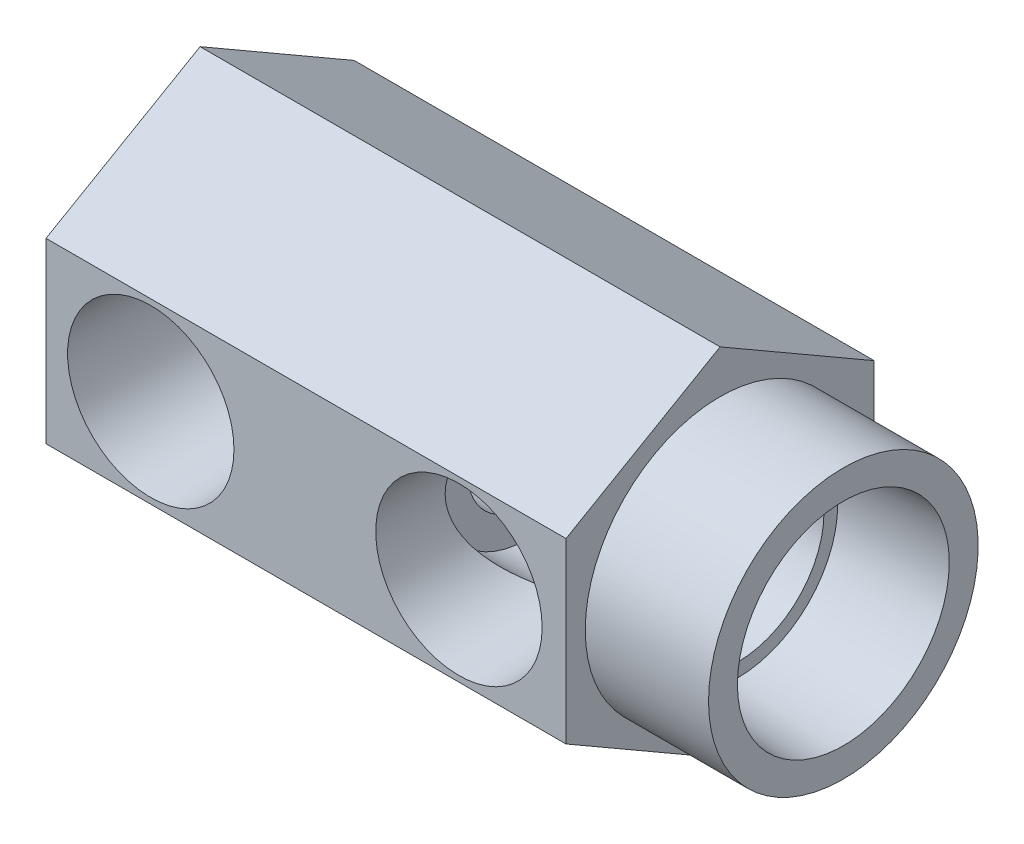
from build123d import *

# Parameters (mm, degrees)
BOSS_EXTRUDE1_DEPTH               = 42.8625
SKETCH2_R                         = 11.1125
BOSS_EXTRUDE2_DEPTH               = 53.0225
F_1_4_NPT_TAPPED_HOLE1_AT_2_COUNT = 2
F_1_4_NPT_TAPPED_HOLE1_AT_2_PITCH = 25.4
F_3_8_24_TAPPED_HOLE1_D           = 8.4328
F_3_8_24_TAPPED_HOLE1_DEPTH       = 44.45254
F_3_8_24_TAPPED_HOLE1_CBORE_D     = 9.525
F_3_8_24_TAPPED_HOLE1_CBORE_DEPTH = 36.576
F_3_8_24_TAPPED_HOLE1_TIP         = 2.533468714


with BuildPart() as part:
    # Sketch1 → Boss-Extrude1 (new body)
    with BuildSketch(Plane(origin=(0, 0, 0), x_dir=(0, 0, -1), z_dir=(1, 0, 0))):
        Polygon((12.7, 7.332348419), (0, 14.664696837), (-12.7, 7.332348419), (-12.7, -7.332348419), (0, -14.664696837), (12.7, -7.332348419), align=None)
    extrude(amount=BOSS_EXTRUDE1_DEPTH)

    # Sketch2 → Boss-Extrude2 (add)
    with BuildSketch(Plane.ZY):
        Circle(SKETCH2_R)
    extrude(amount=-BOSS_EXTRUDE2_DEPTH)

    # Sketch3 → Cut-Revolve1 (revolve, cut)
    with BuildSketch(Plane(origin=(0, 0, 0), x_dir=(1, 0, 0), z_dir=(0, 1, 0)), mode=Mode.PRIVATE) as cut_revolve1_sk:
        Polygon((44.2849, 7.14375), (44.2849, 8.273331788), (53.0225, 8.73125), (53.0225, 0), (26.82875, 0), (26.82875, 7.14375), align=None)
    revolve(cut_revolve1_sk.sketch.rotate(Axis((0, 0, 0), (1, 0, 0)), 180), axis=Axis((0, 0, 0), (1, 0, 0)), mode=Mode.SUBTRACT)

    # Sketch4 → 1_4 NPT Tapped Hole1 (revolve, cut)
    with BuildSketch(Plane(origin=(8.636, 0, 12.7), x_dir=(0, -1, 0), z_dir=(1, 0, 0))):
        Polygon((0, 0), (0, 19.217347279), (5.5626, 15.875), (5.5626, 10.0203), (6.557978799, 10.0203), (6.858, 0), align=None)
    f_1_4_npt_tapped_hole1 = revolve(axis=Axis((8.636, 0, 19.05), (0, 0, -1)), mode=Mode.SUBTRACT)

    # 1_4 NPT Tapped Hole1 at 2: 1_4 NPT Tapped Hole1 ×2
    with Locations(*[(i * F_1_4_NPT_TAPPED_HOLE1_AT_2_PITCH, 0, 0) for i in range(1, F_1_4_NPT_TAPPED_HOLE1_AT_2_COUNT)]):
        add(f_1_4_npt_tapped_hole1, mode=Mode.SUBTRACT)

    # Sketch6 → 1_4 NPT Tapped Hole2 (revolve, cut)
    with BuildSketch(Plane(origin=(8.636, 0, -12.7), x_dir=(0, 1, 0), z_dir=(1, 0, 0))):
        Polygon((0, 0), (0, 20.411147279), (5.5626, 17.0688), (5.5626, 10.0203), (6.557978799, 10.0203), (6.858, 0), align=None)
    revolve(axis=Axis((8.636, 0, -19.05), (0, 0, 1)), mode=Mode.SUBTRACT)

    # 3_8-24 Tapped Hole1
    with Locations(Plane(origin=(53.0225, 0, 0), x_dir=(0, 0, -1), z_dir=(1, 0, 0))):
        with Locations((0, 0)):
            CounterBoreHole(F_3_8_24_TAPPED_HOLE1_D / 2, F_3_8_24_TAPPED_HOLE1_CBORE_D / 2, F_3_8_24_TAPPED_HOLE1_CBORE_DEPTH, depth=F_3_8_24_TAPPED_HOLE1_DEPTH)
            with Locations((0, 0, -(F_3_8_24_TAPPED_HOLE1_DEPTH + F_3_8_24_TAPPED_HOLE1_TIP / 2))):  # 118° drill point
                Cone(0, F_3_8_24_TAPPED_HOLE1_D / 2, F_3_8_24_TAPPED_HOLE1_TIP, mode=Mode.SUBTRACT)


solid = part.part
